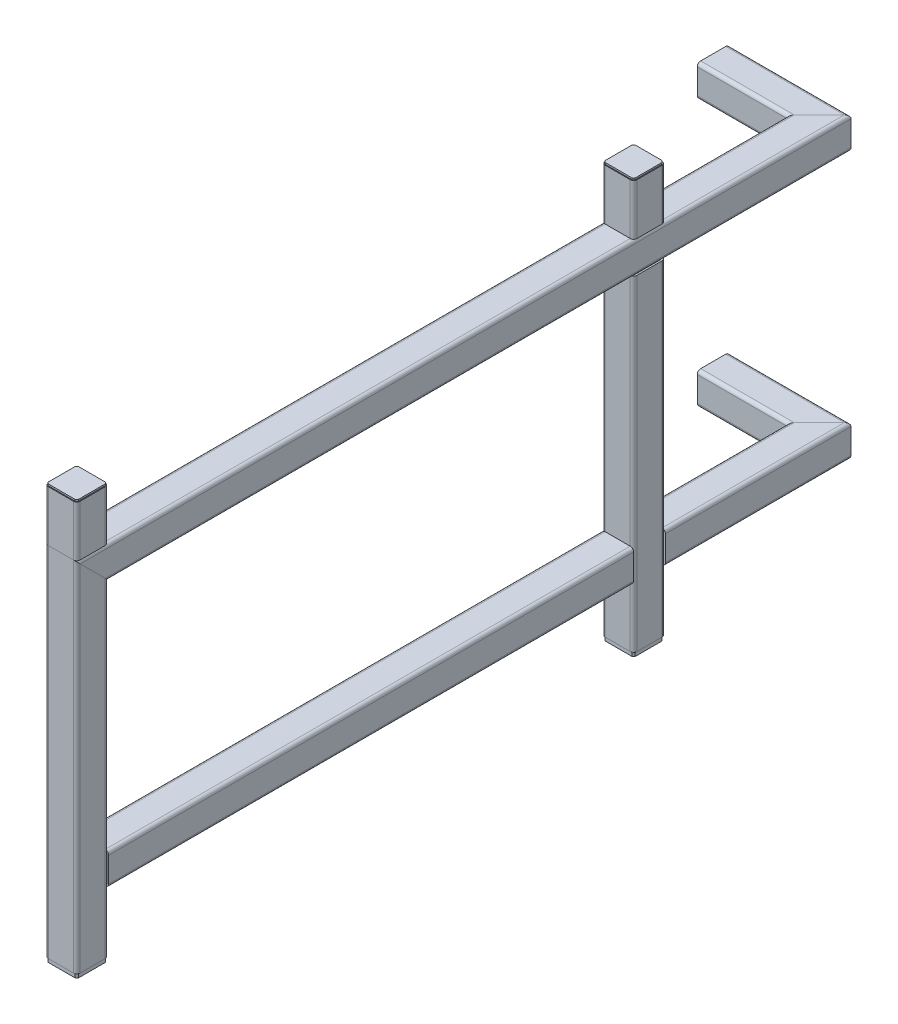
from build123d import *

# Parameters (mm, degrees)
EL_MENT_M_CANO_SOUD_1_DEPTH   = 682.5
EL_MENT_M_CANO_SOUD_1_2_DEPTH = 653.5
EL_MENT_M_CANO_SOUD_1_3_DEPTH = 1444.426406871
EL_MENT_M_CANO_SOUD_1_4_DEPTH = 243.426406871
EL_MENT_M_CANO_SOUD_1_5_DEPTH = 1052
EL_MENT_M_CANO_SOUD_1_6_DEPTH = 394.426406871
EL_MENT_M_CANO_SOUD_1_7_DEPTH = 243.426406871
EMBOUT1_WIDTH                 = 56.8
EMBOUT1_HEIGHT                = 56.8
EMBOUT1_THICKNESS             = 8
EMBOUT1_2_SIZE                = 3
EMBOUT1_4_WIDTH               = 56.8
EMBOUT1_4_HEIGHT              = 56.8
EMBOUT1_4_THICKNESS           = 8
EMBOUT1_5_SIZE                = 3
ESQUISSE2_W                   = 5.1
ESQUISSE2_H                   = 8
ESQUISSE3_W                   = 5.1
ESQUISSE3_H                   = 8
BODY_START                    = 200.705627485
BODY_3_RUN_ON_DEPTH           = 229.705627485
EL_MENT_M_CANO_SOUD_2_DEPTH   = 99
EL_MENT_M_CANO_SOUD_2_2_DEPTH = 99
EMBOUT2_WIDTH                 = 56.8
EMBOUT2_HEIGHT                = 56.8
EMBOUT2_THICKNESS             = 3
EMBOUT2_2_SIZE                = 3
EMBOUT2_4_WIDTH               = 56.8
EMBOUT2_4_HEIGHT              = 56.8
EMBOUT2_4_THICKNESS           = 3
EMBOUT2_5_SIZE                = 3


with BuildPart() as part:
    # Sketch11 → El_ment m_cano-soud_1 (new body)
    with BuildSketch(Plane(origin=(0, 0, 0), x_dir=(1, 0, 0), z_dir=(0, 1, 0))):
        with BuildLine():
            Line((-23.6, -30), (23.6, -30))
            ThreePointArc((23.6, -30), (28.1254834, -28.1254834), (30, -23.6))
            Line((30, -23.6), (30, 23.6))
            ThreePointArc((30, 23.6), (28.1254834, 28.1254834), (23.6, 30))
            Line((23.6, 30), (-23.6, 30))
            ThreePointArc((-23.6, 30), (-28.1254834, 28.1254834), (-30, 23.6))
            Line((-30, 23.6), (-30, -23.6))
            ThreePointArc((-30, -23.6), (-28.1254834, -28.1254834), (-23.6, -30))
        make_face()
        with BuildLine():
            Line((-23.6, -26.8), (23.6, -26.8))
            ThreePointArc((23.6, -26.8), (25.8627417, -25.8627417), (26.8, -23.6))
            Line((26.8, -23.6), (26.8, 23.6))
            ThreePointArc((26.8, 23.6), (25.8627417, 25.8627417), (23.6, 26.8))
            Line((23.6, 26.8), (-23.6, 26.8))
            ThreePointArc((-23.6, 26.8), (-25.8627417, 25.8627417), (-26.8, 23.6))
            Line((-26.8, 23.6), (-26.8, -23.6))
            ThreePointArc((-26.8, -23.6), (-25.8627417, -25.8627417), (-23.6, -26.8))
        make_face(mode=Mode.SUBTRACT)
    extrude(amount=EL_MENT_M_CANO_SOUD_1_DEPTH)

    # Embout1 3
    split(bisect_by=Plane(origin=(0, 8, 0), x_dir=(-1, 0, 0), z_dir=(0, 1, 0)), keep=Keep.TOP)

    # Ajuster_Prolonger1
    split(bisect_by=Plane(origin=(0, 652.5, 0), x_dir=(1, 0, 0), z_dir=(0, -0.707106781, 0.707106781)), keep=Keep.TOP)


with BuildPart() as body_2:
    # Sketch11 on segment 2 (on carried to segment 2) → El_ment m_cano-soud_1 2 (new body)
    with BuildSketch(Plane(origin=(0, 0, -1050), x_dir=(1, 0, 0), z_dir=(0, 1, 0))):
        with BuildLine():
            Line((-23.6, -30), (23.6, -30))
            ThreePointArc((23.6, -30), (28.1254834, -28.1254834), (30, -23.6))
            Line((30, -23.6), (30, 23.6))
            ThreePointArc((30, 23.6), (28.1254834, 28.1254834), (23.6, 30))
            Line((23.6, 30), (-23.6, 30))
            ThreePointArc((-23.6, 30), (-28.1254834, 28.1254834), (-30, 23.6))
            Line((-30, 23.6), (-30, -23.6))
            ThreePointArc((-30, -23.6), (-28.1254834, -28.1254834), (-23.6, -30))
        make_face()
        with BuildLine():
            Line((-23.6, -26.8), (23.6, -26.8))
            ThreePointArc((23.6, -26.8), (25.8627417, -25.8627417), (26.8, -23.6))
            Line((26.8, -23.6), (26.8, 23.6))
            ThreePointArc((26.8, 23.6), (25.8627417, 25.8627417), (23.6, 26.8))
            Line((23.6, 26.8), (-23.6, 26.8))
            ThreePointArc((-23.6, 26.8), (-25.8627417, 25.8627417), (-26.8, 23.6))
            Line((-26.8, 23.6), (-26.8, -23.6))
            ThreePointArc((-26.8, -23.6), (-25.8627417, -25.8627417), (-23.6, -26.8))
        make_face(mode=Mode.SUBTRACT)
    extrude(amount=EL_MENT_M_CANO_SOUD_1_2_DEPTH)

    # El_ment m_cano-soud_1 2 mitre 1
    split(bisect_by=Plane(origin=(0, 622.5, -1050), x_dir=(1, 0, 0), z_dir=(0, -1, 0)), keep=Keep.TOP)

    # Embout1 6
    split(bisect_by=Plane(origin=(0, 8, -1050), x_dir=(-1, 0, 0), z_dir=(0, 1, 0)), keep=Keep.TOP)


with BuildPart() as body_3:
    # Sketch11 on segment 3 (on carried to segment 3) → El_ment m_cano-soud_1 3 (new body)
    with BuildSketch(Plane(origin=(0, 652.5, 1), x_dir=(1, 0, 0), z_dir=(0, 0, -1))):
        with BuildLine():
            Line((-23.6, -30), (23.6, -30))
            ThreePointArc((23.6, -30), (28.1254834, -28.1254834), (30, -23.6))
            Line((30, -23.6), (30, 23.6))
            ThreePointArc((30, 23.6), (28.1254834, 28.1254834), (23.6, 30))
            Line((23.6, 30), (-23.6, 30))
            ThreePointArc((-23.6, 30), (-28.1254834, 28.1254834), (-30, 23.6))
            Line((-30, 23.6), (-30, -23.6))
            ThreePointArc((-30, -23.6), (-28.1254834, -28.1254834), (-23.6, -30))
        make_face()
        with BuildLine():
            Line((-23.6, -26.8), (23.6, -26.8))
            ThreePointArc((23.6, -26.8), (25.8627417, -25.8627417), (26.8, -23.6))
            Line((26.8, -23.6), (26.8, 23.6))
            ThreePointArc((26.8, 23.6), (25.8627417, 25.8627417), (23.6, 26.8))
            Line((23.6, 26.8), (-23.6, 26.8))
            ThreePointArc((-23.6, 26.8), (-25.8627417, 25.8627417), (-26.8, 23.6))
            Line((-26.8, 23.6), (-26.8, -23.6))
            ThreePointArc((-26.8, -23.6), (-25.8627417, -25.8627417), (-23.6, -26.8))
        make_face(mode=Mode.SUBTRACT)
    extrude(amount=EL_MENT_M_CANO_SOUD_1_3_DEPTH)

    # El_ment m_cano-soud_1 3 mitre 1
    split(bisect_by=Plane(origin=(0, 652.5, -1400), x_dir=(0, 1, 0), z_dir=(0.707106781, 0, 0.707106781)), keep=Keep.TOP)

    # El_ment m_cano-soud_1 3 mitre 2
    split(bisect_by=Plane(origin=(0, 652.5, -30), x_dir=(0, 1, 0), z_dir=(0, 0, -1)), keep=Keep.TOP)

    # body 3 cut square before the run-on
    split(bisect_by=Plane(origin=(0, 652.5, -199.705627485), x_dir=(0, 1, 0), z_dir=(0, 0, -1)), keep=Keep.TOP)

    # Sketch11 on segment 3 (on carried to segment 3) → body 3 run on (add)
    with BuildSketch(Plane(origin=(0, 652.5, 1), x_dir=(1, 0, 0), z_dir=(0, 0, -1)).offset(BODY_START)):
        with BuildLine():
            Line((-23.6, -30), (23.6, -30))
            ThreePointArc((23.6, -30), (28.1254834, -28.1254834), (30, -23.6))
            Line((30, -23.6), (30, 23.6))
            ThreePointArc((30, 23.6), (28.1254834, 28.1254834), (23.6, 30))
            Line((23.6, 30), (-23.6, 30))
            ThreePointArc((-23.6, 30), (-28.1254834, 28.1254834), (-30, 23.6))
            Line((-30, 23.6), (-30, -23.6))
            ThreePointArc((-30, -23.6), (-28.1254834, -28.1254834), (-23.6, -30))
        make_face()
        with BuildLine():
            Line((-23.6, -26.8), (23.6, -26.8))
            ThreePointArc((23.6, -26.8), (25.8627417, -25.8627417), (26.8, -23.6))
            Line((26.8, -23.6), (26.8, 23.6))
            ThreePointArc((26.8, 23.6), (25.8627417, 25.8627417), (23.6, 26.8))
            Line((23.6, 26.8), (-23.6, 26.8))
            ThreePointArc((-23.6, 26.8), (-25.8627417, 25.8627417), (-26.8, 23.6))
            Line((-26.8, 23.6), (-26.8, -23.6))
            ThreePointArc((-26.8, -23.6), (-25.8627417, -25.8627417), (-23.6, -26.8))
        make_face(mode=Mode.SUBTRACT)
    extrude(amount=-BODY_3_RUN_ON_DEPTH)

    # Ajuster_Prolonger1
    split(bisect_by=Plane(origin=(0, 652.5, 0), x_dir=(-1, 0, 0), z_dir=(0, 0.707106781, -0.707106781)), keep=Keep.TOP)


with BuildPart() as body_4:
    # Sketch11 on segment 4 (on carried to segment 4) → El_ment m_cano-soud_1 4 (new body)
    with BuildSketch(Plane(origin=(43.426406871, 652.5, -1400), x_dir=(0, 1, 0), z_dir=(-1, 0, 0))):
        with BuildLine():
            Line((-23.6, -30), (23.6, -30))
            ThreePointArc((23.6, -30), (28.1254834, -28.1254834), (30, -23.6))
            Line((30, -23.6), (30, 23.6))
            ThreePointArc((30, 23.6), (28.1254834, 28.1254834), (23.6, 30))
            Line((23.6, 30), (-23.6, 30))
            ThreePointArc((-23.6, 30), (-28.1254834, 28.1254834), (-30, 23.6))
            Line((-30, 23.6), (-30, -23.6))
            ThreePointArc((-30, -23.6), (-28.1254834, -28.1254834), (-23.6, -30))
        make_face()
        with BuildLine():
            Line((-23.6, -26.8), (23.6, -26.8))
            ThreePointArc((23.6, -26.8), (25.8627417, -25.8627417), (26.8, -23.6))
            Line((26.8, -23.6), (26.8, 23.6))
            ThreePointArc((26.8, 23.6), (25.8627417, 25.8627417), (23.6, 26.8))
            Line((23.6, 26.8), (-23.6, 26.8))
            ThreePointArc((-23.6, 26.8), (-25.8627417, 25.8627417), (-26.8, 23.6))
            Line((-26.8, 23.6), (-26.8, -23.6))
            ThreePointArc((-26.8, -23.6), (-25.8627417, -25.8627417), (-23.6, -26.8))
        make_face(mode=Mode.SUBTRACT)
    extrude(amount=EL_MENT_M_CANO_SOUD_1_4_DEPTH)

    # El_ment m_cano-soud_1 4 mitre 1
    split(bisect_by=Plane(origin=(0, 652.5, -1400), x_dir=(0, -1, 0), z_dir=(-0.707106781, 0, -0.707106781)), keep=Keep.TOP)


with BuildPart() as body_5:
    # Sketch11 on segment 5 (on carried to segment 5) → El_ment m_cano-soud_1 5 (new body)
    with BuildSketch(Plane(origin=(0, 150, 1), x_dir=(1, 0, 0), z_dir=(0, 0, -1))):
        with BuildLine():
            Line((-23.6, -30), (23.6, -30))
            ThreePointArc((23.6, -30), (28.1254834, -28.1254834), (30, -23.6))
            Line((30, -23.6), (30, 23.6))
            ThreePointArc((30, 23.6), (28.1254834, 28.1254834), (23.6, 30))
            Line((23.6, 30), (-23.6, 30))
            ThreePointArc((-23.6, 30), (-28.1254834, 28.1254834), (-30, 23.6))
            Line((-30, 23.6), (-30, -23.6))
            ThreePointArc((-30, -23.6), (-28.1254834, -28.1254834), (-23.6, -30))
        make_face()
        with BuildLine():
            Line((-23.6, -26.8), (23.6, -26.8))
            ThreePointArc((23.6, -26.8), (25.8627417, -25.8627417), (26.8, -23.6))
            Line((26.8, -23.6), (26.8, 23.6))
            ThreePointArc((26.8, 23.6), (25.8627417, 25.8627417), (23.6, 26.8))
            Line((23.6, 26.8), (-23.6, 26.8))
            ThreePointArc((-23.6, 26.8), (-25.8627417, 25.8627417), (-26.8, 23.6))
            Line((-26.8, 23.6), (-26.8, -23.6))
            ThreePointArc((-26.8, -23.6), (-25.8627417, -25.8627417), (-23.6, -26.8))
        make_face(mode=Mode.SUBTRACT)
    extrude(amount=EL_MENT_M_CANO_SOUD_1_5_DEPTH)

    # El_ment m_cano-soud_1 5 mitre 1
    split(bisect_by=Plane(origin=(0, 150, -1050), x_dir=(0, -1, 0), z_dir=(0, 0, 1)), keep=Keep.TOP)

    # El_ment m_cano-soud_1 5 mitre 2
    split(bisect_by=Plane(origin=(0, 150, -30), x_dir=(0, 1, 0), z_dir=(0, 0, -1)), keep=Keep.TOP)

    # El_ment m_cano-soud_1 5 mitre 3
    split(bisect_by=Plane(origin=(0, 150, -1020), x_dir=(0, -1, 0), z_dir=(0, 0, 1)), keep=Keep.TOP)


with BuildPart() as body_6:
    # Sketch11 on segment 6 (on carried to segment 6) → El_ment m_cano-soud_1 6 (new body)
    with BuildSketch(Plane(origin=(0, 150, -1049), x_dir=(1, 0, 0), z_dir=(0, 0, -1))):
        with BuildLine():
            Line((-23.6, -30), (23.6, -30))
            ThreePointArc((23.6, -30), (28.1254834, -28.1254834), (30, -23.6))
            Line((30, -23.6), (30, 23.6))
            ThreePointArc((30, 23.6), (28.1254834, 28.1254834), (23.6, 30))
            Line((23.6, 30), (-23.6, 30))
            ThreePointArc((-23.6, 30), (-28.1254834, 28.1254834), (-30, 23.6))
            Line((-30, 23.6), (-30, -23.6))
            ThreePointArc((-30, -23.6), (-28.1254834, -28.1254834), (-23.6, -30))
        make_face()
        with BuildLine():
            Line((-23.6, -26.8), (23.6, -26.8))
            ThreePointArc((23.6, -26.8), (25.8627417, -25.8627417), (26.8, -23.6))
            Line((26.8, -23.6), (26.8, 23.6))
            ThreePointArc((26.8, 23.6), (25.8627417, 25.8627417), (23.6, 26.8))
            Line((23.6, 26.8), (-23.6, 26.8))
            ThreePointArc((-23.6, 26.8), (-25.8627417, 25.8627417), (-26.8, 23.6))
            Line((-26.8, 23.6), (-26.8, -23.6))
            ThreePointArc((-26.8, -23.6), (-25.8627417, -25.8627417), (-23.6, -26.8))
        make_face(mode=Mode.SUBTRACT)
    extrude(amount=EL_MENT_M_CANO_SOUD_1_6_DEPTH)

    # El_ment m_cano-soud_1 6 mitre 1
    split(bisect_by=Plane(origin=(0, 150, -1050), x_dir=(0, 1, 0), z_dir=(0, 0, -1)), keep=Keep.TOP)

    # El_ment m_cano-soud_1 6 mitre 2
    split(bisect_by=Plane(origin=(0, 150, -1400), x_dir=(0, 1, 0), z_dir=(0.707106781, 0, 0.707106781)), keep=Keep.TOP)

    # El_ment m_cano-soud_1 6 mitre 3
    split(bisect_by=Plane(origin=(0, 150, -1080), x_dir=(0, 1, 0), z_dir=(0, 0, -1)), keep=Keep.TOP)


with BuildPart() as body_7:
    # Sketch11 on segment 7 (on carried to segment 7) → El_ment m_cano-soud_1 7 (new body)
    with BuildSketch(Plane(origin=(43.426406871, 150, -1400), x_dir=(0, 1, 0), z_dir=(-1, 0, 0))):
        with BuildLine():
            Line((-23.6, -30), (23.6, -30))
            ThreePointArc((23.6, -30), (28.1254834, -28.1254834), (30, -23.6))
            Line((30, -23.6), (30, 23.6))
            ThreePointArc((30, 23.6), (28.1254834, 28.1254834), (23.6, 30))
            Line((23.6, 30), (-23.6, 30))
            ThreePointArc((-23.6, 30), (-28.1254834, 28.1254834), (-30, 23.6))
            Line((-30, 23.6), (-30, -23.6))
            ThreePointArc((-30, -23.6), (-28.1254834, -28.1254834), (-23.6, -30))
        make_face()
        with BuildLine():
            Line((-23.6, -26.8), (23.6, -26.8))
            ThreePointArc((23.6, -26.8), (25.8627417, -25.8627417), (26.8, -23.6))
            Line((26.8, -23.6), (26.8, 23.6))
            ThreePointArc((26.8, 23.6), (25.8627417, 25.8627417), (23.6, 26.8))
            Line((23.6, 26.8), (-23.6, 26.8))
            ThreePointArc((-23.6, 26.8), (-25.8627417, 25.8627417), (-26.8, 23.6))
            Line((-26.8, 23.6), (-26.8, -23.6))
            ThreePointArc((-26.8, -23.6), (-25.8627417, -25.8627417), (-23.6, -26.8))
        make_face(mode=Mode.SUBTRACT)
    extrude(amount=EL_MENT_M_CANO_SOUD_1_7_DEPTH)

    # El_ment m_cano-soud_1 7 mitre 1
    split(bisect_by=Plane(origin=(0, 150, -1400), x_dir=(0, -1, 0), z_dir=(-0.707106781, 0, -0.707106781)), keep=Keep.TOP)


with BuildPart() as body_8:
    # Embout1: an end cap: a rectangular plate 8.0 thick over the member's open end
    with BuildSketch(Plane(origin=(0, 0, 0), x_dir=(1, 0, 0), z_dir=(0, -1, 0))):
        Rectangle(EMBOUT1_WIDTH, EMBOUT1_HEIGHT)
    extrude(amount=-EMBOUT1_THICKNESS)

    # Embout1 2
    embout1_2_edges = [body_8.edges().sort_by_distance(p)[0] for p in [
        (-28.4, 4, -28.4),
        (-28.4, 4, 28.4),
        (28.4, 4, -28.4),
        (28.4, 4, 28.4),
    ]]
    chamfer(embout1_2_edges, length=EMBOUT1_2_SIZE)

    # Esquisse2 → Trou taraud_ M121 (revolve, cut)
    with BuildSketch(Plane(origin=(0, 0, 0), x_dir=(0, 0, -1), z_dir=(1, 0, 0))):
        with Locations((2.55, 4)):
            Rectangle(ESQUISSE2_W, ESQUISSE2_H)
    revolve(axis=Axis((0, -6.35, 0), (0, 1, 0)), mode=Mode.SUBTRACT)


with BuildPart() as body_9:
    # Embout1 4: an end cap: a rectangular plate 8.0 thick over the member's open end
    with BuildSketch(Plane(origin=(0, 0, -1050), x_dir=(1, 0, 0), z_dir=(0, -1, 0))):
        Rectangle(EMBOUT1_4_WIDTH, EMBOUT1_4_HEIGHT)
    extrude(amount=-EMBOUT1_4_THICKNESS)

    # Embout1 5
    embout1_5_edges = [body_9.edges().sort_by_distance(p)[0] for p in [
        (-28.4, 4, -1078.4),
        (-28.4, 4, -1021.6),
        (28.4, 4, -1078.4),
        (28.4, 4, -1021.6),
    ]]
    chamfer(embout1_5_edges, length=EMBOUT1_5_SIZE)

    # Esquisse3 → Trou taraud_ M122 (revolve, cut)
    with BuildSketch(Plane(origin=(0, 0, -1050), x_dir=(0, 0, -1), z_dir=(1, 0, 0))):
        with Locations((2.55, 4)):
            Rectangle(ESQUISSE3_W, ESQUISSE3_H)
    revolve(axis=Axis((0, -6.35, -1050), (0, 1, 0)), mode=Mode.SUBTRACT)


with BuildPart() as body_10:
    # Sketch1 → El_ment m_cano-soud_2 (new body)
    with BuildSketch(Plane.ZX.offset(682.5)):
        with BuildLine():
            Line((-23.6, -30), (23.6, -30))
            ThreePointArc((23.6, -30), (28.1254834, -28.1254834), (30, -23.6))
            Line((30, -23.6), (30, 23.6))
            ThreePointArc((30, 23.6), (28.1254834, 28.1254834), (23.6, 30))
            Line((23.6, 30), (-23.6, 30))
            ThreePointArc((-23.6, 30), (-28.1254834, 28.1254834), (-30, 23.6))
            Line((-30, 23.6), (-30, -23.6))
            ThreePointArc((-30, -23.6), (-28.1254834, -28.1254834), (-23.6, -30))
        make_face()
        with BuildLine():
            Line((-23.6, -26.8), (23.6, -26.8))
            ThreePointArc((23.6, -26.8), (25.8627417, -25.8627417), (26.8, -23.6))
            Line((26.8, -23.6), (26.8, 23.6))
            ThreePointArc((26.8, 23.6), (25.8627417, 25.8627417), (23.6, 26.8))
            Line((23.6, 26.8), (-23.6, 26.8))
            ThreePointArc((-23.6, 26.8), (-25.8627417, 25.8627417), (-26.8, 23.6))
            Line((-26.8, 23.6), (-26.8, -23.6))
            ThreePointArc((-26.8, -23.6), (-25.8627417, -25.8627417), (-23.6, -26.8))
        make_face(mode=Mode.SUBTRACT)
    extrude(amount=EL_MENT_M_CANO_SOUD_2_DEPTH)

    # Embout2 3
    split(bisect_by=Plane.XZ.offset(-778.5), keep=Keep.TOP)


with BuildPart() as body_11:
    # Sketch1 on segment 2 (on carried to segment 2) → El_ment m_cano-soud_2 2 (new body)
    with BuildSketch(Plane(origin=(0, 682.5, -1050), x_dir=(0, 0, 1), z_dir=(0, 1, 0))):
        with BuildLine():
            Line((-23.6, -30), (23.6, -30))
            ThreePointArc((23.6, -30), (28.1254834, -28.1254834), (30, -23.6))
            Line((30, -23.6), (30, 23.6))
            ThreePointArc((30, 23.6), (28.1254834, 28.1254834), (23.6, 30))
            Line((23.6, 30), (-23.6, 30))
            ThreePointArc((-23.6, 30), (-28.1254834, 28.1254834), (-30, 23.6))
            Line((-30, 23.6), (-30, -23.6))
            ThreePointArc((-30, -23.6), (-28.1254834, -28.1254834), (-23.6, -30))
        make_face()
        with BuildLine():
            Line((-23.6, -26.8), (23.6, -26.8))
            ThreePointArc((23.6, -26.8), (25.8627417, -25.8627417), (26.8, -23.6))
            Line((26.8, -23.6), (26.8, 23.6))
            ThreePointArc((26.8, 23.6), (25.8627417, 25.8627417), (23.6, 26.8))
            Line((23.6, 26.8), (-23.6, 26.8))
            ThreePointArc((-23.6, 26.8), (-25.8627417, 25.8627417), (-26.8, 23.6))
            Line((-26.8, 23.6), (-26.8, -23.6))
            ThreePointArc((-26.8, -23.6), (-25.8627417, -25.8627417), (-23.6, -26.8))
        make_face(mode=Mode.SUBTRACT)
    extrude(amount=EL_MENT_M_CANO_SOUD_2_2_DEPTH)

    # Embout2 6
    split(bisect_by=Plane(origin=(0, 778.5, -1050), x_dir=(1, 0, 0), z_dir=(0, -1, 0)), keep=Keep.TOP)


with BuildPart() as body_12:
    # Embout2: an end cap: a rectangular plate 3.0 thick over the member's open end
    with BuildSketch(Plane(origin=(0, 781.5, 0), x_dir=(0, 0, 1), z_dir=(0, 1, 0))):
        Rectangle(EMBOUT2_WIDTH, EMBOUT2_HEIGHT)
    extrude(amount=-EMBOUT2_THICKNESS)

    # Embout2 2
    embout2_2_edges = [body_12.edges().sort_by_distance(p)[0] for p in [
        (-28.4, 780, -28.4),
        (28.4, 780, -28.4),
        (-28.4, 780, 28.4),
        (28.4, 780, 28.4),
    ]]
    chamfer(embout2_2_edges, length=EMBOUT2_2_SIZE)


with BuildPart() as body_13:
    # Embout2 4: an end cap: a rectangular plate 3.0 thick over the member's open end
    with BuildSketch(Plane(origin=(0, 781.5, -1050), x_dir=(0, 0, 1), z_dir=(0, 1, 0))):
        Rectangle(EMBOUT2_4_WIDTH, EMBOUT2_4_HEIGHT)
    extrude(amount=-EMBOUT2_4_THICKNESS)

    # Embout2 5
    embout2_5_edges = [body_13.edges().sort_by_distance(p)[0] for p in [
        (-28.4, 780, -1078.4),
        (28.4, 780, -1078.4),
        (-28.4, 780, -1021.6),
        (28.4, 780, -1021.6),
    ]]
    chamfer(embout2_5_edges, length=EMBOUT2_5_SIZE)


solid = Compound([part.part, body_2.part, body_3.part, body_4.part, body_5.part, body_6.part, body_7.part, body_8.part, body_9.part, body_10.part, body_11.part, body_12.part, body_13.part])
